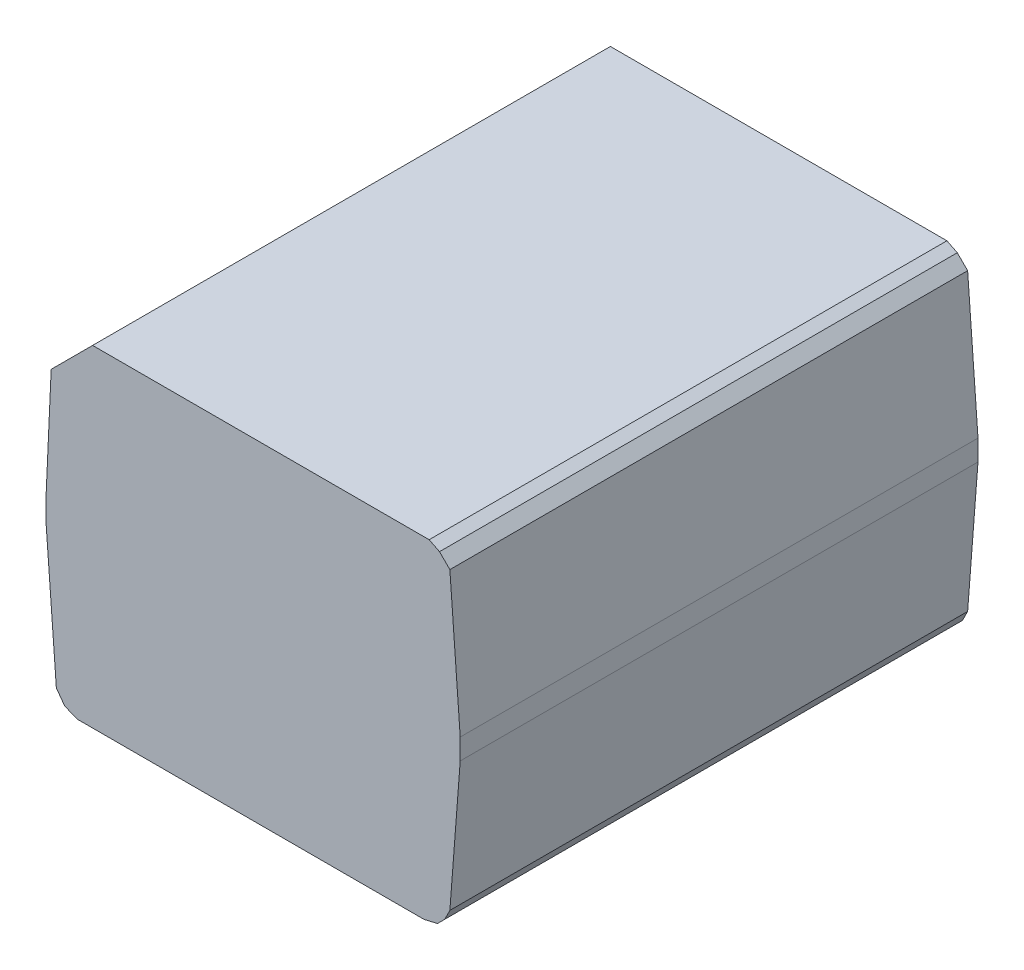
ISO-10303-21;
HEADER;
FILE_DESCRIPTION(('STEP AP214'),'2;1');
FILE_NAME('part.step','',(''),(''),'','','');
FILE_SCHEMA(('AUTOMOTIVE_DESIGN { 1 0 10303 214 1 1 1 1 }'));
ENDSEC;
DATA;
#1=APPLICATION_CONTEXT('core data for automotive mechanical design processes');
#2=APPLICATION_PROTOCOL_DEFINITION('international standard','automotive_design',2000,#1);
#3=PRODUCT_CONTEXT('',#1,'mechanical');
#4=PRODUCT('Part','Part','',(#3));
#5=PRODUCT_RELATED_PRODUCT_CATEGORY('part','',(#4));
#6=PRODUCT_DEFINITION_FORMATION('','',#4);
#7=PRODUCT_DEFINITION_CONTEXT('part definition',#1,'design');
#8=PRODUCT_DEFINITION('design','',#6,#7);
#9=PRODUCT_DEFINITION_SHAPE('','',#8);
#10=(LENGTH_UNIT() NAMED_UNIT(*) SI_UNIT(.MILLI.,.METRE.));
#11=(NAMED_UNIT(*) PLANE_ANGLE_UNIT() SI_UNIT($,.RADIAN.));
#12=(NAMED_UNIT(*) SI_UNIT($,.STERADIAN.) SOLID_ANGLE_UNIT());
#13=UNCERTAINTY_MEASURE_WITH_UNIT(LENGTH_MEASURE(1.E-05),#10,'distance_accuracy_value','');
#14=(GEOMETRIC_REPRESENTATION_CONTEXT(3) GLOBAL_UNCERTAINTY_ASSIGNED_CONTEXT((#13)) GLOBAL_UNIT_ASSIGNED_CONTEXT((#10,
#11,#12)) REPRESENTATION_CONTEXT('',''));
#15=CARTESIAN_POINT('',(0.,0.,0.));
#16=DIRECTION('',(0.,0.,1.));
#17=DIRECTION('',(1.,0.,0.));
#18=AXIS2_PLACEMENT_3D('',#15,#16,#17);
#19=CARTESIAN_POINT('',(2.00000108,0.0999998,0.));
#20=DIRECTION('',(1.,0.,0.));
#21=DIRECTION('',(0.,0.,-1.));
#22=AXIS2_PLACEMENT_3D('',#19,#20,#21);
#23=PLANE('',#22);
#24=DIRECTION('',(0.,0.,1.));
#25=VECTOR('',#24,1.);
#26=CARTESIAN_POINT('',(2.00000108,-0.0999998,0.));
#27=LINE('',#26,#25);
#28=CARTESIAN_POINT('',(2.00000108,-0.0999998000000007,0.));
#29=VERTEX_POINT('',#28);
#30=CARTESIAN_POINT('',(2.00000108,-0.0999998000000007,5.));
#31=VERTEX_POINT('',#30);
#32=EDGE_CURVE('E153',#29,#31,#27,.T.);
#33=ORIENTED_EDGE('',*,*,#32,.F.);
#34=DIRECTION('',(0.,1.,0.));
#35=VECTOR('',#34,1.);
#36=CARTESIAN_POINT('',(2.00000108,0.0999998,0.));
#37=LINE('',#36,#35);
#38=CARTESIAN_POINT('',(2.00000108,0.0999997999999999,0.));
#39=VERTEX_POINT('',#38);
#40=EDGE_CURVE('E128',#29,#39,#37,.T.);
#41=ORIENTED_EDGE('',*,*,#40,.T.);
#42=DIRECTION('',(0.,0.,1.));
#43=VECTOR('',#42,1.);
#44=CARTESIAN_POINT('',(2.00000108,0.0999997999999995,0.));
#45=LINE('',#44,#43);
#46=CARTESIAN_POINT('',(2.00000108,0.0999997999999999,5.));
#47=VERTEX_POINT('',#46);
#48=EDGE_CURVE('E142',#47,#39,#45,.F.);
#49=ORIENTED_EDGE('',*,*,#48,.F.);
#50=DIRECTION('',(0.,1.,0.));
#51=VECTOR('',#50,1.);
#52=CARTESIAN_POINT('',(2.00000108,0.0999998,5.));
#53=LINE('',#52,#51);
#54=EDGE_CURVE('E20',#47,#31,#53,.F.);
#55=ORIENTED_EDGE('',*,*,#54,.T.);
#56=EDGE_LOOP('',(#33,#41,#49,#55));
#57=FACE_BOUND('',#56,.T.);
#58=ADVANCED_FACE('F17',(#57),#23,.T.);
#59=CARTESIAN_POINT('',(1.90000128,1.44999964,0.));
#60=DIRECTION('',(0.997267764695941,0.0738715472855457,0.));
#61=DIRECTION('',(-0.0738715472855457,0.997267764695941,0.));
#62=AXIS2_PLACEMENT_3D('',#59,#60,#61);
#63=PLANE('',#62);
#64=ORIENTED_EDGE('',*,*,#48,.T.);
#65=DIRECTION('',(-0.0738715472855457,0.997267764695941,0.));
#66=VECTOR('',#65,1.);
#67=CARTESIAN_POINT('',(1.90000128,1.44999964,0.));
#68=LINE('',#67,#66);
#69=CARTESIAN_POINT('',(1.90000128,1.44999964,0.));
#70=VERTEX_POINT('',#69);
#71=EDGE_CURVE('E144',#39,#70,#68,.T.);
#72=ORIENTED_EDGE('',*,*,#71,.T.);
#73=DIRECTION('',(0.,0.,1.));
#74=VECTOR('',#73,1.);
#75=CARTESIAN_POINT('',(1.90000128,1.44999964,0.));
#76=LINE('',#75,#74);
#77=CARTESIAN_POINT('',(1.90000128,1.44999964,5.));
#78=VERTEX_POINT('',#77);
#79=EDGE_CURVE('E148',#78,#70,#76,.F.);
#80=ORIENTED_EDGE('',*,*,#79,.F.);
#81=DIRECTION('',(-0.0738715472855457,0.997267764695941,0.));
#82=VECTOR('',#81,1.);
#83=CARTESIAN_POINT('',(1.90000128,1.44999964,5.));
#84=LINE('',#83,#82);
#85=EDGE_CURVE('E136',#78,#47,#84,.F.);
#86=ORIENTED_EDGE('',*,*,#85,.T.);
#87=EDGE_LOOP('',(#64,#72,#80,#86));
#88=FACE_BOUND('',#87,.T.);
#89=ADVANCED_FACE('F146',(#88),#63,.T.);
#90=CARTESIAN_POINT('',(2.00000108,-0.0999998,0.));
#91=DIRECTION('',(0.997054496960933,-0.0766963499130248,0.));
#92=DIRECTION('',(0.0766963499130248,0.997054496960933,0.));
#93=AXIS2_PLACEMENT_3D('',#90,#91,#92);
#94=PLANE('',#93);
#95=DIRECTION('',(0.,0.,1.));
#96=VECTOR('',#95,1.);
#97=CARTESIAN_POINT('',(1.90000128,-1.39999974,0.));
#98=LINE('',#97,#96);
#99=CARTESIAN_POINT('',(1.90000128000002,-1.39999974,0.));
#100=VERTEX_POINT('',#99);
#101=CARTESIAN_POINT('',(1.90000128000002,-1.39999974,5.));
#102=VERTEX_POINT('',#101);
#103=EDGE_CURVE('E176',#100,#102,#98,.T.);
#104=ORIENTED_EDGE('',*,*,#103,.F.);
#105=DIRECTION('',(0.0766963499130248,0.997054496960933,0.));
#106=VECTOR('',#105,1.);
#107=CARTESIAN_POINT('',(2.00000108,-0.0999998,0.));
#108=LINE('',#107,#106);
#109=EDGE_CURVE('E156',#100,#29,#108,.T.);
#110=ORIENTED_EDGE('',*,*,#109,.T.);
#111=ORIENTED_EDGE('',*,*,#32,.T.);
#112=DIRECTION('',(0.0766963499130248,0.997054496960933,0.));
#113=VECTOR('',#112,1.);
#114=CARTESIAN_POINT('',(2.00000108,-0.0999998,5.));
#115=LINE('',#114,#113);
#116=EDGE_CURVE('E139',#31,#102,#115,.F.);
#117=ORIENTED_EDGE('',*,*,#116,.T.);
#118=EDGE_LOOP('',(#104,#110,#111,#117));
#119=FACE_BOUND('',#118,.T.);
#120=ADVANCED_FACE('F282',(#119),#94,.T.);
#121=CARTESIAN_POINT('',(-1.99999854,-0.0999998,0.));
#122=DIRECTION('',(-1.,0.,0.));
#123=DIRECTION('',(0.,0.,1.));
#124=AXIS2_PLACEMENT_3D('',#121,#122,#123);
#125=PLANE('',#124);
#126=DIRECTION('',(0.,0.,1.));
#127=VECTOR('',#126,1.);
#128=CARTESIAN_POINT('',(-1.99999854,0.0999998,0.));
#129=LINE('',#128,#127);
#130=CARTESIAN_POINT('',(-1.99999854,0.0999998,0.));
#131=VERTEX_POINT('',#130);
#132=CARTESIAN_POINT('',(-1.99999854,0.0999998,5.));
#133=VERTEX_POINT('',#132);
#134=EDGE_CURVE('E163',#131,#133,#129,.T.);
#135=ORIENTED_EDGE('',*,*,#134,.F.);
#136=DIRECTION('',(0.,1.,0.));
#137=VECTOR('',#136,1.);
#138=CARTESIAN_POINT('',(-1.99999854,-0.0999998,0.));
#139=LINE('',#138,#137);
#140=CARTESIAN_POINT('',(-1.99999853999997,-0.0999997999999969,0.));
#141=VERTEX_POINT('',#140);
#142=EDGE_CURVE('E161',#131,#141,#139,.F.);
#143=ORIENTED_EDGE('',*,*,#142,.T.);
#144=DIRECTION('',(0.,0.,1.));
#145=VECTOR('',#144,1.);
#146=CARTESIAN_POINT('',(-1.99999853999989,-0.0999997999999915,0.));
#147=LINE('',#146,#145);
#148=CARTESIAN_POINT('',(-1.99999853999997,-0.0999997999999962,5.));
#149=VERTEX_POINT('',#148);
#150=EDGE_CURVE('E187',#149,#141,#147,.F.);
#151=ORIENTED_EDGE('',*,*,#150,.F.);
#152=DIRECTION('',(0.,1.,0.));
#153=VECTOR('',#152,1.);
#154=CARTESIAN_POINT('',(-1.99999854,-0.0999998,5.));
#155=LINE('',#154,#153);
#156=EDGE_CURVE('E159',#149,#133,#155,.T.);
#157=ORIENTED_EDGE('',*,*,#156,.T.);
#158=EDGE_LOOP('',(#135,#143,#151,#157));
#159=FACE_BOUND('',#158,.T.);
#160=ADVANCED_FACE('F305',(#159),#125,.T.);
#161=CARTESIAN_POINT('',(-1.99999854,0.0999998,0.));
#162=DIRECTION('',(-0.998968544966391,0.0454075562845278,0.));
#163=DIRECTION('',(-0.0454075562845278,-0.998968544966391,0.));
#164=AXIS2_PLACEMENT_3D('',#161,#162,#163);
#165=PLANE('',#164);
#166=DIRECTION('',(0.,0.,1.));
#167=VECTOR('',#166,1.);
#168=CARTESIAN_POINT('',(-1.94999864,1.20000014,0.));
#169=LINE('',#168,#167);
#170=CARTESIAN_POINT('',(-1.94999863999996,1.20000014,0.));
#171=VERTEX_POINT('',#170);
#172=CARTESIAN_POINT('',(-1.94999863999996,1.20000014,5.));
#173=VERTEX_POINT('',#172);
#174=EDGE_CURVE('E192',#171,#173,#169,.T.);
#175=ORIENTED_EDGE('',*,*,#174,.F.);
#176=DIRECTION('',(-0.0454075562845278,-0.998968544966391,0.));
#177=VECTOR('',#176,1.);
#178=CARTESIAN_POINT('',(-1.99999854,0.0999998,0.));
#179=LINE('',#178,#177);
#180=EDGE_CURVE('E168',#171,#131,#179,.T.);
#181=ORIENTED_EDGE('',*,*,#180,.T.);
#182=ORIENTED_EDGE('',*,*,#134,.T.);
#183=DIRECTION('',(-0.0454075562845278,-0.998968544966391,0.));
#184=VECTOR('',#183,1.);
#185=CARTESIAN_POINT('',(-1.99999854,0.0999998,5.));
#186=LINE('',#185,#184);
#187=EDGE_CURVE('E166',#133,#173,#186,.F.);
#188=ORIENTED_EDGE('',*,*,#187,.T.);
#189=EDGE_LOOP('',(#175,#181,#182,#188));
#190=FACE_BOUND('',#189,.T.);
#191=ADVANCED_FACE('F303',(#190),#165,.T.);
#192=CARTESIAN_POINT('',(1.80000148,1.54999944,0.));
#193=DIRECTION('',(0.707106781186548,0.707106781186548,0.));
#194=DIRECTION('',(-0.707106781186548,0.707106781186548,0.));
#195=AXIS2_PLACEMENT_3D('',#192,#193,#194);
#196=PLANE('',#195);
#197=ORIENTED_EDGE('',*,*,#79,.T.);
#198=DIRECTION('',(-0.707106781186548,0.707106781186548,0.));
#199=VECTOR('',#198,1.);
#200=CARTESIAN_POINT('',(1.80000148,1.54999944,0.));
#201=LINE('',#200,#199);
#202=CARTESIAN_POINT('',(1.80000148,1.54999944,0.));
#203=VERTEX_POINT('',#202);
#204=EDGE_CURVE('E174',#70,#203,#201,.T.);
#205=ORIENTED_EDGE('',*,*,#204,.T.);
#206=DIRECTION('',(0.,0.,1.));
#207=VECTOR('',#206,1.);
#208=CARTESIAN_POINT('',(1.80000148,1.54999944,0.));
#209=LINE('',#208,#207);
#210=CARTESIAN_POINT('',(1.80000148,1.54999944,5.));
#211=VERTEX_POINT('',#210);
#212=EDGE_CURVE('E203',#211,#203,#209,.F.);
#213=ORIENTED_EDGE('',*,*,#212,.F.);
#214=DIRECTION('',(-0.707106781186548,0.707106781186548,0.));
#215=VECTOR('',#214,1.);
#216=CARTESIAN_POINT('',(1.80000148,1.54999944,5.));
#217=LINE('',#216,#215);
#218=EDGE_CURVE('E171',#211,#78,#217,.F.);
#219=ORIENTED_EDGE('',*,*,#218,.T.);
#220=EDGE_LOOP('',(#197,#205,#213,#219));
#221=FACE_BOUND('',#220,.T.);
#222=ADVANCED_FACE('F288',(#221),#196,.T.);
#223=CARTESIAN_POINT('',(1.90000128,-1.39999974,0.));
#224=DIRECTION('',(0.894427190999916,-0.447213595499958,0.));
#225=DIRECTION('',(0.447213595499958,0.894427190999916,0.));
#226=AXIS2_PLACEMENT_3D('',#223,#224,#225);
#227=PLANE('',#226);
#228=DIRECTION('',(0.,0.,1.));
#229=VECTOR('',#228,1.);
#230=CARTESIAN_POINT('',(1.85000138,-1.49999954,0.));
#231=LINE('',#230,#229);
#232=CARTESIAN_POINT('',(1.85000138,-1.49999954,0.));
#233=VERTEX_POINT('',#232);
#234=CARTESIAN_POINT('',(1.85000138,-1.49999954,5.));
#235=VERTEX_POINT('',#234);
#236=EDGE_CURVE('E208',#233,#235,#231,.T.);
#237=ORIENTED_EDGE('',*,*,#236,.F.);
#238=DIRECTION('',(0.447213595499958,0.894427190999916,0.));
#239=VECTOR('',#238,1.);
#240=CARTESIAN_POINT('',(1.90000128,-1.39999974,0.));
#241=LINE('',#240,#239);
#242=EDGE_CURVE('E181',#233,#100,#241,.T.);
#243=ORIENTED_EDGE('',*,*,#242,.T.);
#244=ORIENTED_EDGE('',*,*,#103,.T.);
#245=DIRECTION('',(0.447213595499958,0.894427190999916,0.));
#246=VECTOR('',#245,1.);
#247=CARTESIAN_POINT('',(1.90000128,-1.39999974,5.));
#248=LINE('',#247,#246);
#249=EDGE_CURVE('E179',#102,#235,#248,.F.);
#250=ORIENTED_EDGE('',*,*,#249,.T.);
#251=EDGE_LOOP('',(#237,#243,#244,#250));
#252=FACE_BOUND('',#251,.T.);
#253=ADVANCED_FACE('F279',(#252),#227,.T.);
#254=CARTESIAN_POINT('',(-1.89999874,-1.43999966,0.));
#255=DIRECTION('',(-0.997227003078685,-0.0744197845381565,0.));
#256=DIRECTION('',(0.0744197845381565,-0.997227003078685,0.));
#257=AXIS2_PLACEMENT_3D('',#254,#255,#256);
#258=PLANE('',#257);
#259=ORIENTED_EDGE('',*,*,#150,.T.);
#260=DIRECTION('',(0.0744197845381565,-0.997227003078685,0.));
#261=VECTOR('',#260,1.);
#262=CARTESIAN_POINT('',(-1.89999874,-1.43999966,0.));
#263=LINE('',#262,#261);
#264=CARTESIAN_POINT('',(-1.89999874,-1.43999966,0.));
#265=VERTEX_POINT('',#264);
#266=EDGE_CURVE('E190',#141,#265,#263,.T.);
#267=ORIENTED_EDGE('',*,*,#266,.T.);
#268=DIRECTION('',(0.,0.,1.));
#269=VECTOR('',#268,1.);
#270=CARTESIAN_POINT('',(-1.89999874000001,-1.43999966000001,0.));
#271=LINE('',#270,#269);
#272=CARTESIAN_POINT('',(-1.89999874,-1.43999966,5.));
#273=VERTEX_POINT('',#272);
#274=EDGE_CURVE('E216',#273,#265,#271,.F.);
#275=ORIENTED_EDGE('',*,*,#274,.F.);
#276=DIRECTION('',(0.0744197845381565,-0.997227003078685,0.));
#277=VECTOR('',#276,1.);
#278=CARTESIAN_POINT('',(-1.89999874,-1.43999966,5.));
#279=LINE('',#278,#277);
#280=EDGE_CURVE('E184',#273,#149,#279,.F.);
#281=ORIENTED_EDGE('',*,*,#280,.T.);
#282=EDGE_LOOP('',(#259,#267,#275,#281));
#283=FACE_BOUND('',#282,.T.);
#284=ADVANCED_FACE('F307',(#283),#258,.T.);
#285=CARTESIAN_POINT('',(-1.94999864,1.20000014,0.));
#286=DIRECTION('',(-0.707106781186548,0.707106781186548,0.));
#287=DIRECTION('',(-0.707106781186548,-0.707106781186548,0.));
#288=AXIS2_PLACEMENT_3D('',#285,#286,#287);
#289=PLANE('',#288);
#290=DIRECTION('',(0.,0.,1.));
#291=VECTOR('',#290,1.);
#292=CARTESIAN_POINT('',(-1.54999944,1.59999934,0.));
#293=LINE('',#292,#291);
#294=CARTESIAN_POINT('',(-1.54999944,1.59999934,0.));
#295=VERTEX_POINT('',#294);
#296=CARTESIAN_POINT('',(-1.54999944,1.59999934,5.));
#297=VERTEX_POINT('',#296);
#298=EDGE_CURVE('E221',#295,#297,#293,.T.);
#299=ORIENTED_EDGE('',*,*,#298,.F.);
#300=DIRECTION('',(-0.707106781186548,-0.707106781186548,0.));
#301=VECTOR('',#300,1.);
#302=CARTESIAN_POINT('',(-1.94999864,1.20000014,0.));
#303=LINE('',#302,#301);
#304=EDGE_CURVE('E197',#295,#171,#303,.T.);
#305=ORIENTED_EDGE('',*,*,#304,.T.);
#306=ORIENTED_EDGE('',*,*,#174,.T.);
#307=DIRECTION('',(-0.707106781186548,-0.707106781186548,0.));
#308=VECTOR('',#307,1.);
#309=CARTESIAN_POINT('',(-1.94999864,1.20000014,5.));
#310=LINE('',#309,#308);
#311=EDGE_CURVE('E195',#173,#297,#310,.F.);
#312=ORIENTED_EDGE('',*,*,#311,.T.);
#313=EDGE_LOOP('',(#299,#305,#306,#312));
#314=FACE_BOUND('',#313,.T.);
#315=ADVANCED_FACE('F297',(#314),#289,.T.);
#316=CARTESIAN_POINT('',(1.70000168,1.59999934,0.));
#317=DIRECTION('',(0.447213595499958,0.894427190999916,0.));
#318=DIRECTION('',(-0.894427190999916,0.447213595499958,0.));
#319=AXIS2_PLACEMENT_3D('',#316,#317,#318);
#320=PLANE('',#319);
#321=ORIENTED_EDGE('',*,*,#212,.T.);
#322=DIRECTION('',(-0.894427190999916,0.447213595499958,0.));
#323=VECTOR('',#322,1.);
#324=CARTESIAN_POINT('',(1.70000168,1.59999934,0.));
#325=LINE('',#324,#323);
#326=CARTESIAN_POINT('',(1.70000168,1.59999934,0.));
#327=VERTEX_POINT('',#326);
#328=EDGE_CURVE('E206',#203,#327,#325,.T.);
#329=ORIENTED_EDGE('',*,*,#328,.T.);
#330=DIRECTION('',(0.,0.,1.));
#331=VECTOR('',#330,1.);
#332=CARTESIAN_POINT('',(1.70000168,1.59999934,0.));
#333=LINE('',#332,#331);
#334=CARTESIAN_POINT('',(1.70000168,1.59999934,5.));
#335=VERTEX_POINT('',#334);
#336=EDGE_CURVE('E224',#335,#327,#333,.F.);
#337=ORIENTED_EDGE('',*,*,#336,.F.);
#338=DIRECTION('',(-0.894427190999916,0.447213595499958,0.));
#339=VECTOR('',#338,1.);
#340=CARTESIAN_POINT('',(1.70000168,1.59999934,5.));
#341=LINE('',#340,#339);
#342=EDGE_CURVE('E200',#335,#211,#341,.F.);
#343=ORIENTED_EDGE('',*,*,#342,.T.);
#344=EDGE_LOOP('',(#321,#329,#337,#343));
#345=FACE_BOUND('',#344,.T.);
#346=ADVANCED_FACE('F292',(#345),#320,.T.);
#347=CARTESIAN_POINT('',(1.85000138,-1.49999954,0.));
#348=DIRECTION('',(0.707106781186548,-0.707106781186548,0.));
#349=DIRECTION('',(0.707106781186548,0.707106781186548,0.));
#350=AXIS2_PLACEMENT_3D('',#347,#348,#349);
#351=PLANE('',#350);
#352=DIRECTION('',(0.,0.,1.));
#353=VECTOR('',#352,1.);
#354=CARTESIAN_POINT('',(1.78000152,-1.5699994,0.));
#355=LINE('',#354,#353);
#356=CARTESIAN_POINT('',(1.78000152,-1.5699994,0.));
#357=VERTEX_POINT('',#356);
#358=CARTESIAN_POINT('',(1.78000152,-1.5699994,5.));
#359=VERTEX_POINT('',#358);
#360=EDGE_CURVE('E227',#357,#359,#355,.T.);
#361=ORIENTED_EDGE('',*,*,#360,.F.);
#362=DIRECTION('',(0.707106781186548,0.707106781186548,0.));
#363=VECTOR('',#362,1.);
#364=CARTESIAN_POINT('',(1.85000138,-1.49999954,0.));
#365=LINE('',#364,#363);
#366=EDGE_CURVE('E213',#357,#233,#365,.T.);
#367=ORIENTED_EDGE('',*,*,#366,.T.);
#368=ORIENTED_EDGE('',*,*,#236,.T.);
#369=DIRECTION('',(0.707106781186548,0.707106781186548,0.));
#370=VECTOR('',#369,1.);
#371=CARTESIAN_POINT('',(1.85000138,-1.49999954,5.));
#372=LINE('',#371,#370);
#373=EDGE_CURVE('E211',#235,#359,#372,.F.);
#374=ORIENTED_EDGE('',*,*,#373,.T.);
#375=EDGE_LOOP('',(#361,#367,#368,#374));
#376=FACE_BOUND('',#375,.T.);
#377=ADVANCED_FACE('F277',(#376),#351,.T.);
#378=CARTESIAN_POINT('',(-1.8199989,-1.54999944,0.));
#379=DIRECTION('',(-0.808736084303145,-0.588171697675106,0.));
#380=DIRECTION('',(0.588171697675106,-0.808736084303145,0.));
#381=AXIS2_PLACEMENT_3D('',#378,#379,#380);
#382=PLANE('',#381);
#383=ORIENTED_EDGE('',*,*,#274,.T.);
#384=DIRECTION('',(0.588171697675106,-0.808736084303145,0.));
#385=VECTOR('',#384,1.);
#386=CARTESIAN_POINT('',(-1.8199989,-1.54999944,0.));
#387=LINE('',#386,#385);
#388=CARTESIAN_POINT('',(-1.8199989,-1.54999944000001,0.));
#389=VERTEX_POINT('',#388);
#390=EDGE_CURVE('E219',#265,#389,#387,.T.);
#391=ORIENTED_EDGE('',*,*,#390,.T.);
#392=DIRECTION('',(0.,0.,1.));
#393=VECTOR('',#392,1.);
#394=CARTESIAN_POINT('',(-1.81999890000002,-1.54999944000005,0.));
#395=LINE('',#394,#393);
#396=CARTESIAN_POINT('',(-1.8199989,-1.54999944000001,5.));
#397=VERTEX_POINT('',#396);
#398=EDGE_CURVE('E241',#397,#389,#395,.F.);
#399=ORIENTED_EDGE('',*,*,#398,.F.);
#400=DIRECTION('',(0.588171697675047,-0.808736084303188,0.));
#401=VECTOR('',#400,1.);
#402=CARTESIAN_POINT('',(-1.89999874,-1.43999966,5.));
#403=LINE('',#402,#401);
#404=EDGE_CURVE('E230',#273,#397,#403,.T.);
#405=ORIENTED_EDGE('',*,*,#404,.F.);
#406=EDGE_LOOP('',(#383,#391,#399,#405));
#407=FACE_BOUND('',#406,.T.);
#408=ADVANCED_FACE('F265',(#407),#382,.T.);
#409=CARTESIAN_POINT('',(-1.54999944,1.59999934,0.));
#410=DIRECTION('',(0.,1.,0.));
#411=DIRECTION('',(0.,0.,1.));
#412=AXIS2_PLACEMENT_3D('',#409,#410,#411);
#413=PLANE('',#412);
#414=ORIENTED_EDGE('',*,*,#336,.T.);
#415=DIRECTION('',(1.,0.,0.));
#416=VECTOR('',#415,1.);
#417=CARTESIAN_POINT('',(-1.99999854,1.59999934,0.));
#418=LINE('',#417,#416);
#419=EDGE_CURVE('E247',#327,#295,#418,.F.);
#420=ORIENTED_EDGE('',*,*,#419,.T.);
#421=ORIENTED_EDGE('',*,*,#298,.T.);
#422=DIRECTION('',(1.,0.,0.));
#423=VECTOR('',#422,1.);
#424=CARTESIAN_POINT('',(-1.99999854,1.59999934,5.));
#425=LINE('',#424,#423);
#426=EDGE_CURVE('E235',#335,#297,#425,.F.);
#427=ORIENTED_EDGE('',*,*,#426,.F.);
#428=EDGE_LOOP('',(#414,#420,#421,#427));
#429=FACE_BOUND('',#428,.T.);
#430=ADVANCED_FACE('F294',(#429),#413,.T.);
#431=CARTESIAN_POINT('',(1.78000152,-1.5699994,0.));
#432=DIRECTION('',(0.224859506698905,-0.974391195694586,0.));
#433=DIRECTION('',(0.974391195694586,0.224859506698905,0.));
#434=AXIS2_PLACEMENT_3D('',#431,#432,#433);
#435=PLANE('',#434);
#436=DIRECTION('',(0.,0.,-1.));
#437=VECTOR('',#436,1.);
#438=CARTESIAN_POINT('',(1.65000178,-1.59999934,0.));
#439=LINE('',#438,#437);
#440=CARTESIAN_POINT('',(1.65000178,-1.59999934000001,0.));
#441=VERTEX_POINT('',#440);
#442=CARTESIAN_POINT('',(1.65000178,-1.59999934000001,5.));
#443=VERTEX_POINT('',#442);
#444=EDGE_CURVE('E250',#441,#443,#439,.F.);
#445=ORIENTED_EDGE('',*,*,#444,.F.);
#446=DIRECTION('',(0.97439119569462,0.224859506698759,0.));
#447=VECTOR('',#446,1.);
#448=CARTESIAN_POINT('',(1.65000178,-1.59999934,0.));
#449=LINE('',#448,#447);
#450=EDGE_CURVE('E244',#441,#357,#449,.T.);
#451=ORIENTED_EDGE('',*,*,#450,.T.);
#452=ORIENTED_EDGE('',*,*,#360,.T.);
#453=DIRECTION('',(0.97439119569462,0.224859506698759,0.));
#454=VECTOR('',#453,1.);
#455=CARTESIAN_POINT('',(1.65000178,-1.59999934,5.));
#456=LINE('',#455,#454);
#457=EDGE_CURVE('E232',#443,#359,#456,.T.);
#458=ORIENTED_EDGE('',*,*,#457,.F.);
#459=EDGE_LOOP('',(#445,#451,#452,#458));
#460=FACE_BOUND('',#459,.T.);
#461=ADVANCED_FACE('F273',(#460),#435,.T.);
#462=CARTESIAN_POINT('',(-1.99999854,0.0999998,5.));
#463=DIRECTION('',(0.,0.,1.));
#464=DIRECTION('',(1.,0.,0.));
#465=AXIS2_PLACEMENT_3D('',#462,#463,#464);
#466=PLANE('',#465);
#467=ORIENTED_EDGE('',*,*,#311,.F.);
#468=ORIENTED_EDGE('',*,*,#187,.F.);
#469=ORIENTED_EDGE('',*,*,#156,.F.);
#470=ORIENTED_EDGE('',*,*,#280,.F.);
#471=ORIENTED_EDGE('',*,*,#404,.T.);
#472=DIRECTION('',(0.923076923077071,-0.38461538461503,0.));
#473=VECTOR('',#472,1.);
#474=CARTESIAN_POINT('',(-1.69999914,-1.59999934,5.));
#475=LINE('',#474,#473);
#476=CARTESIAN_POINT('',(-1.69999914,-1.59999934,5.));
#477=VERTEX_POINT('',#476);
#478=EDGE_CURVE('E238',#477,#397,#475,.F.);
#479=ORIENTED_EDGE('',*,*,#478,.F.);
#480=DIRECTION('',(1.,0.,0.));
#481=VECTOR('',#480,1.);
#482=CARTESIAN_POINT('',(1.65000178,-1.59999934,5.));
#483=LINE('',#482,#481);
#484=EDGE_CURVE('E253',#443,#477,#483,.F.);
#485=ORIENTED_EDGE('',*,*,#484,.F.);
#486=ORIENTED_EDGE('',*,*,#457,.T.);
#487=ORIENTED_EDGE('',*,*,#373,.F.);
#488=ORIENTED_EDGE('',*,*,#249,.F.);
#489=ORIENTED_EDGE('',*,*,#116,.F.);
#490=ORIENTED_EDGE('',*,*,#54,.F.);
#491=ORIENTED_EDGE('',*,*,#85,.F.);
#492=ORIENTED_EDGE('',*,*,#218,.F.);
#493=ORIENTED_EDGE('',*,*,#342,.F.);
#494=ORIENTED_EDGE('',*,*,#426,.T.);
#495=EDGE_LOOP('',(#467,#468,#469,#470,#471,#479,#485,#486,#487,#488,#489,#490,#491,#492,#493,#494));
#496=FACE_BOUND('',#495,.T.);
#497=ADVANCED_FACE('F134',(#496),#466,.T.);
#498=CARTESIAN_POINT('',(-1.69999914,-1.59999934,0.));
#499=DIRECTION('',(-0.38461538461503,-0.923076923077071,0.));
#500=DIRECTION('',(0.923076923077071,-0.38461538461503,0.));
#501=AXIS2_PLACEMENT_3D('',#498,#499,#500);
#502=PLANE('',#501);
#503=ORIENTED_EDGE('',*,*,#398,.T.);
#504=DIRECTION('',(0.923076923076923,-0.384615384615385,0.));
#505=VECTOR('',#504,1.);
#506=CARTESIAN_POINT('',(-1.8199989,-1.54999944,0.));
#507=LINE('',#506,#505);
#508=CARTESIAN_POINT('',(-1.69999914,-1.59999934,0.));
#509=VERTEX_POINT('',#508);
#510=EDGE_CURVE('E35',#389,#509,#507,.T.);
#511=ORIENTED_EDGE('',*,*,#510,.T.);
#512=DIRECTION('',(0.,0.,-1.));
#513=VECTOR('',#512,1.);
#514=CARTESIAN_POINT('',(-1.69999914,-1.59999934,0.));
#515=LINE('',#514,#513);
#516=EDGE_CURVE('E26',#477,#509,#515,.T.);
#517=ORIENTED_EDGE('',*,*,#516,.F.);
#518=ORIENTED_EDGE('',*,*,#478,.T.);
#519=EDGE_LOOP('',(#503,#511,#517,#518));
#520=FACE_BOUND('',#519,.T.);
#521=ADVANCED_FACE('F260',(#520),#502,.T.);
#522=CARTESIAN_POINT('',(-1.99999854,0.0999998,0.));
#523=DIRECTION('',(0.,0.,1.));
#524=DIRECTION('',(1.,0.,0.));
#525=AXIS2_PLACEMENT_3D('',#522,#523,#524);
#526=PLANE('',#525);
#527=ORIENTED_EDGE('',*,*,#304,.F.);
#528=ORIENTED_EDGE('',*,*,#419,.F.);
#529=ORIENTED_EDGE('',*,*,#328,.F.);
#530=ORIENTED_EDGE('',*,*,#204,.F.);
#531=ORIENTED_EDGE('',*,*,#71,.F.);
#532=ORIENTED_EDGE('',*,*,#40,.F.);
#533=ORIENTED_EDGE('',*,*,#109,.F.);
#534=ORIENTED_EDGE('',*,*,#242,.F.);
#535=ORIENTED_EDGE('',*,*,#366,.F.);
#536=ORIENTED_EDGE('',*,*,#450,.F.);
#537=DIRECTION('',(1.,0.,0.));
#538=VECTOR('',#537,1.);
#539=CARTESIAN_POINT('',(1.65000178,-1.59999934,0.));
#540=LINE('',#539,#538);
#541=EDGE_CURVE('E11',#509,#441,#540,.T.);
#542=ORIENTED_EDGE('',*,*,#541,.F.);
#543=ORIENTED_EDGE('',*,*,#510,.F.);
#544=ORIENTED_EDGE('',*,*,#390,.F.);
#545=ORIENTED_EDGE('',*,*,#266,.F.);
#546=ORIENTED_EDGE('',*,*,#142,.F.);
#547=ORIENTED_EDGE('',*,*,#180,.F.);
#548=EDGE_LOOP('',(#527,#528,#529,#530,#531,#532,#533,#534,#535,#536,#542,#543,#544,#545,#546,#547));
#549=FACE_BOUND('',#548,.T.);
#550=ADVANCED_FACE('F269',(#549),#526,.F.);
#551=CARTESIAN_POINT('',(1.65000178,-1.59999934,0.));
#552=DIRECTION('',(0.,-1.,0.));
#553=DIRECTION('',(0.,0.,-1.));
#554=AXIS2_PLACEMENT_3D('',#551,#552,#553);
#555=PLANE('',#554);
#556=ORIENTED_EDGE('',*,*,#516,.T.);
#557=ORIENTED_EDGE('',*,*,#541,.T.);
#558=ORIENTED_EDGE('',*,*,#444,.T.);
#559=ORIENTED_EDGE('',*,*,#484,.T.);
#560=EDGE_LOOP('',(#556,#557,#558,#559));
#561=FACE_BOUND('',#560,.T.);
#562=ADVANCED_FACE('F258',(#561),#555,.T.);
#563=CLOSED_SHELL('',(#58,#89,#120,#160,#191,#222,#253,#284,#315,#346,#377,#408,#430,#461,#497,
#521,#550,#562));
#564=MANIFOLD_SOLID_BREP('B1',#563);
#565=ADVANCED_BREP_SHAPE_REPRESENTATION('',(#18,#564),#14);
#566=SHAPE_DEFINITION_REPRESENTATION(#9,#565);
ENDSEC;
END-ISO-10303-21;
